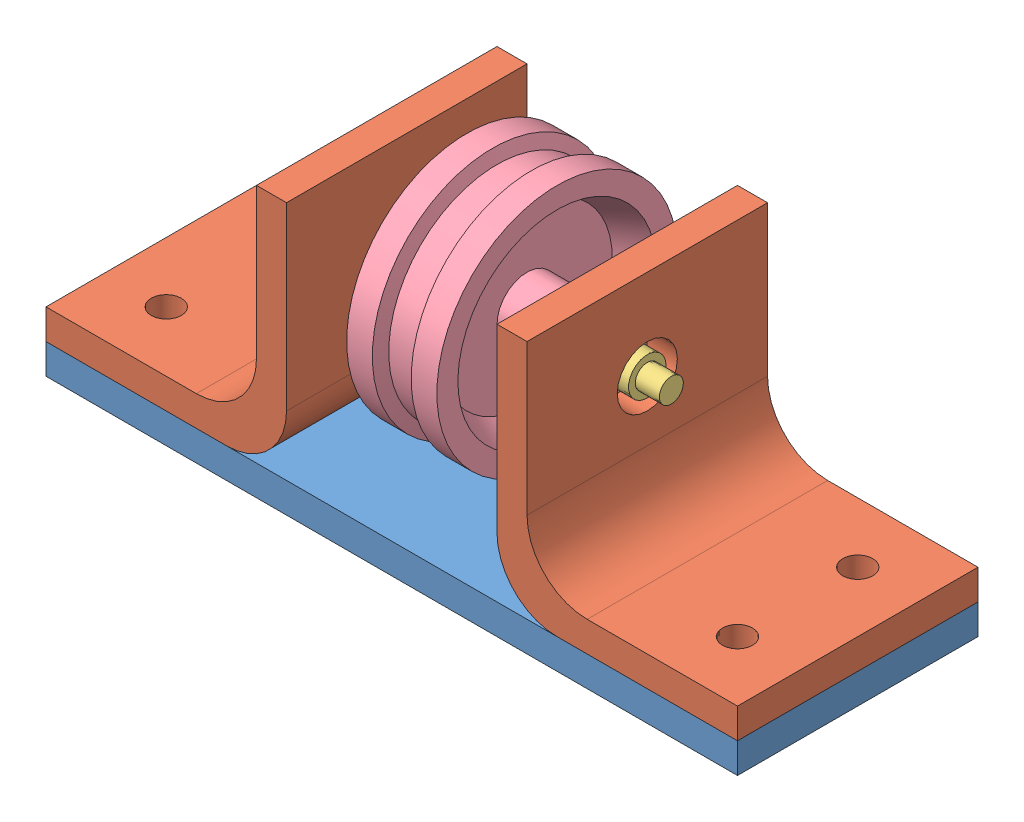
SolidWorks assembly wheel support assembly.SLDASM, configuration Default (file format 9000). Lengths in mm.
Overall size (115 57.49 54.98).
5 component instances, 4 part files, 11 mates.
Components (placement in the parent):
- base-1: base.SLDPRT [Default] at (-14.408 50.4324 112.9956) size (115 5 40)
- support-1: support.SLDPRT [Default] at (-14.408 55.4324 72.9956) size (40 40 40)
- support-2: support.SLDPRT [Default] at (100.592 55.4324 112.9956) x (-1 0 0) z (0 0 -1) size (40 40 40)
- shoulder screw-1: shoulder screw.SLDPRT [Default] at (14.592 80.4324 92.9956) x (1 0 0) z (0 0.7762 -0.630487) size (55 6.25 6.25)
- wheel-1: wheel.SLDPRT [Default] at (43.092 80.4324 92.9956) x (0 0.853608 -0.520916) z (1 0 0) size (40 40 15)
Mates (geometry in assembly coordinates):
- Concentric1: concentric aligned: cylinder of base-1 through (-4.408 55.4324 82.9956) axis (0 -1 0) radius 2.5; cylinder of support-1 through (-4.408 95.4324 82.9956) axis (0 -1 0) radius 2.5
- Coincident1: coincident aligned: plane of base-1 through (-14.408 55.4324 112.9956) normal (0 0 1); plane of support-1 through (10.592 70.4324 112.9956) normal (0 0 1)
- Coincident2: coincident anti-aligned: plane of base-1 through (-14.408 55.4324 112.9956) normal (0 1 0); plane of support-1 through (-14.408 55.4324 112.9956) normal (0 -1 0)
- Concentric2: concentric aligned: cylinder of base-1 through (90.592 55.4324 102.9956) axis (0 -1 0) radius 2.5; cylinder of support-2 through (90.592 95.4324 102.9956) axis (0 -1 0) radius 2.5
- Coincident3: coincident aligned: plane of base-1 through (-14.408 55.4324 112.9956) normal (0 0 1); plane of support-2 through (75.592 70.4324 112.9956) normal (0 0 1)
- Coincident4: coincident anti-aligned: plane of base-1 through (-14.408 55.4324 112.9956) normal (0 1 0); plane of support-2 through (100.592 55.4324 72.9956) normal (0 -1 0)
- Coincident5: coincident aligned: plane of support-2 through (65.592 70.4324 72.9956) normal (1 0 0); plane of shoulder screw-1 through (65.592 78.4621 90.57) normal (1 0 0)
- Concentric3: concentric aligned: cylinder of support-2 through (100.592 80.4324 92.9956) axis (-1 0 0) radius 5; cylinder of shoulder screw-1 through (14.592 80.4324 92.9956) axis (-1 0 0) radius 3.125
- Concentric4: concentric anti-aligned: cylinder of shoulder screw-1 through (14.592 80.4324 92.9956) axis (-1 0 0) radius 3.125; cylinder of wheel-1 through (55.0618 80.4324 92.9956) axis (1 0 0) radius 3.125
- Distance1: distance = 10 mm anti-aligned: plane of support-1 through (25.592 65.4324 112.9956) normal (1 0 0); plane of wheel-1 through (35.592 90.8507 110.0678) normal (-1 0 0)
- Concentric5: concentric anti-aligned: cylinder of support-1 through (-14.408 80.4324 92.9956) axis (1 0 0) radius 5; cylinder of shoulder screw-1 through (14.592 80.4324 92.9956) axis (-1 0 0) radius 3.125
